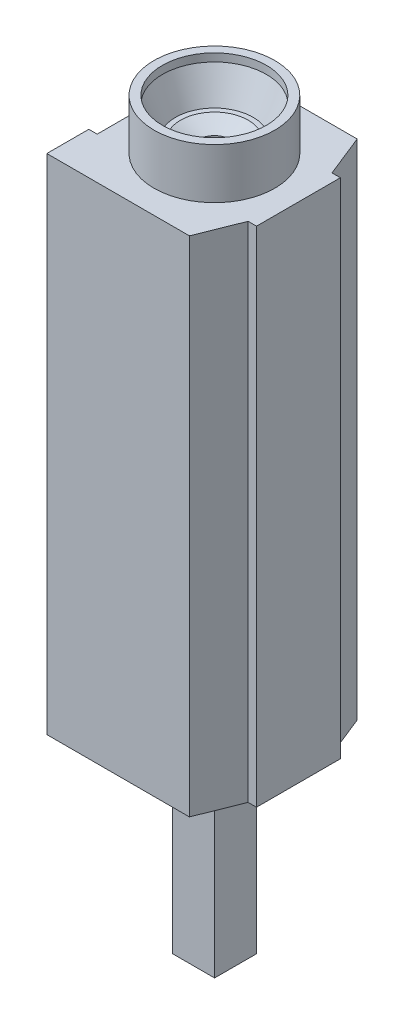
ISO-10303-21;
HEADER;
FILE_DESCRIPTION(('STEP AP214'),'2;1');
FILE_NAME('part.step','',(''),(''),'','','');
FILE_SCHEMA(('AUTOMOTIVE_DESIGN { 1 0 10303 214 1 1 1 1 }'));
ENDSEC;
DATA;
#1=APPLICATION_CONTEXT('core data for automotive mechanical design processes');
#2=APPLICATION_PROTOCOL_DEFINITION('international standard','automotive_design',2000,#1);
#3=PRODUCT_CONTEXT('',#1,'mechanical');
#4=PRODUCT('Part','Part','',(#3));
#5=PRODUCT_RELATED_PRODUCT_CATEGORY('part','',(#4));
#6=PRODUCT_DEFINITION_FORMATION('','',#4);
#7=PRODUCT_DEFINITION_CONTEXT('part definition',#1,'design');
#8=PRODUCT_DEFINITION('design','',#6,#7);
#9=PRODUCT_DEFINITION_SHAPE('','',#8);
#10=(LENGTH_UNIT() NAMED_UNIT(*) SI_UNIT(.MILLI.,.METRE.));
#11=(NAMED_UNIT(*) PLANE_ANGLE_UNIT() SI_UNIT($,.RADIAN.));
#12=(NAMED_UNIT(*) SI_UNIT($,.STERADIAN.) SOLID_ANGLE_UNIT());
#13=UNCERTAINTY_MEASURE_WITH_UNIT(LENGTH_MEASURE(1.E-05),#10,'distance_accuracy_value','');
#14=(GEOMETRIC_REPRESENTATION_CONTEXT(3) GLOBAL_UNCERTAINTY_ASSIGNED_CONTEXT((#13)) GLOBAL_UNIT_ASSIGNED_CONTEXT((#10,
#11,#12)) REPRESENTATION_CONTEXT('',''));
#15=CARTESIAN_POINT('',(0.,0.,0.));
#16=DIRECTION('',(0.,0.,1.));
#17=DIRECTION('',(1.,0.,0.));
#18=AXIS2_PLACEMENT_3D('',#15,#16,#17);
#19=CARTESIAN_POINT('',(-1.27,0.,0.635));
#20=DIRECTION('',(0.,1.,0.));
#21=DIRECTION('',(0.,0.,1.));
#22=AXIS2_PLACEMENT_3D('',#19,#20,#21);
#23=PLANE('',#22);
#24=DIRECTION('',(-0.371390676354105,0.,-0.928476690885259));
#25=VECTOR('',#24,1.);
#26=CARTESIAN_POINT('',(1.143,0.,-0.635000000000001));
#27=LINE('',#26,#25);
#28=CARTESIAN_POINT('',(1.143,0.,-0.635000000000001));
#29=VERTEX_POINT('',#28);
#30=CARTESIAN_POINT('',(0.889000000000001,0.,-1.27));
#31=VERTEX_POINT('',#30);
#32=EDGE_CURVE('E211',#29,#31,#27,.T.);
#33=ORIENTED_EDGE('',*,*,#32,.F.);
#34=DIRECTION('',(1.,0.,0.));
#35=VECTOR('',#34,1.);
#36=CARTESIAN_POINT('',(-1.27,0.,-0.635000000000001));
#37=LINE('',#36,#35);
#38=CARTESIAN_POINT('',(1.27,0.,-0.635000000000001));
#39=VERTEX_POINT('',#38);
#40=EDGE_CURVE('E297',#29,#39,#37,.T.);
#41=ORIENTED_EDGE('',*,*,#40,.T.);
#42=DIRECTION('',(0.,0.,-1.));
#43=VECTOR('',#42,1.);
#44=CARTESIAN_POINT('',(1.27,0.,-1.27));
#45=LINE('',#44,#43);
#46=CARTESIAN_POINT('',(1.27,0.,0.635000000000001));
#47=VERTEX_POINT('',#46);
#48=EDGE_CURVE('E276',#47,#39,#45,.T.);
#49=ORIENTED_EDGE('',*,*,#48,.F.);
#50=DIRECTION('',(1.,0.,0.));
#51=VECTOR('',#50,1.);
#52=CARTESIAN_POINT('',(1.397,0.,0.635000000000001));
#53=LINE('',#52,#51);
#54=CARTESIAN_POINT('',(1.143,0.,0.635000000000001));
#55=VERTEX_POINT('',#54);
#56=EDGE_CURVE('E225',#55,#47,#53,.T.);
#57=ORIENTED_EDGE('',*,*,#56,.F.);
#58=DIRECTION('',(0.371390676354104,0.,-0.928476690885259));
#59=VECTOR('',#58,1.);
#60=CARTESIAN_POINT('',(1.143,0.,0.635000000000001));
#61=LINE('',#60,#59);
#62=CARTESIAN_POINT('',(0.889,0.,1.27));
#63=VERTEX_POINT('',#62);
#64=EDGE_CURVE('E227',#63,#55,#61,.T.);
#65=ORIENTED_EDGE('',*,*,#64,.F.);
#66=DIRECTION('',(1.,0.,0.));
#67=VECTOR('',#66,1.);
#68=CARTESIAN_POINT('',(-1.27,0.,1.27));
#69=LINE('',#68,#67);
#70=CARTESIAN_POINT('',(-1.27,0.,1.27));
#71=VERTEX_POINT('',#70);
#72=EDGE_CURVE('E273',#71,#63,#69,.T.);
#73=ORIENTED_EDGE('',*,*,#72,.F.);
#74=DIRECTION('',(0.,0.,1.));
#75=VECTOR('',#74,1.);
#76=CARTESIAN_POINT('',(-1.27,0.,0.635));
#77=LINE('',#76,#75);
#78=CARTESIAN_POINT('',(-1.27,0.,0.635));
#79=VERTEX_POINT('',#78);
#80=EDGE_CURVE('E271',#79,#71,#77,.T.);
#81=ORIENTED_EDGE('',*,*,#80,.F.);
#82=DIRECTION('',(-1.,0.,0.));
#83=VECTOR('',#82,1.);
#84=CARTESIAN_POINT('',(-1.27,0.,0.635));
#85=LINE('',#84,#83);
#86=CARTESIAN_POINT('',(-1.143,0.,0.635));
#87=VERTEX_POINT('',#86);
#88=EDGE_CURVE('E269',#87,#79,#85,.T.);
#89=ORIENTED_EDGE('',*,*,#88,.F.);
#90=DIRECTION('',(0.,0.,1.));
#91=VECTOR('',#90,1.);
#92=CARTESIAN_POINT('',(-1.143,0.,-0.635));
#93=LINE('',#92,#91);
#94=CARTESIAN_POINT('',(-1.143,0.,-0.635));
#95=VERTEX_POINT('',#94);
#96=EDGE_CURVE('E267',#95,#87,#93,.T.);
#97=ORIENTED_EDGE('',*,*,#96,.F.);
#98=DIRECTION('',(1.,0.,0.));
#99=VECTOR('',#98,1.);
#100=CARTESIAN_POINT('',(-1.27,0.,-0.635));
#101=LINE('',#100,#99);
#102=CARTESIAN_POINT('',(-1.27,0.,-0.635));
#103=VERTEX_POINT('',#102);
#104=EDGE_CURVE('E265',#103,#95,#101,.T.);
#105=ORIENTED_EDGE('',*,*,#104,.F.);
#106=DIRECTION('',(0.,0.,1.));
#107=VECTOR('',#106,1.);
#108=CARTESIAN_POINT('',(-1.27,0.,-1.27));
#109=LINE('',#108,#107);
#110=CARTESIAN_POINT('',(-1.27,0.,-1.27));
#111=VERTEX_POINT('',#110);
#112=EDGE_CURVE('E241',#111,#103,#109,.T.);
#113=ORIENTED_EDGE('',*,*,#112,.F.);
#114=DIRECTION('',(-1.,0.,0.));
#115=VECTOR('',#114,1.);
#116=CARTESIAN_POINT('',(-1.27,0.,-1.27));
#117=LINE('',#116,#115);
#118=EDGE_CURVE('E246',#31,#111,#117,.T.);
#119=ORIENTED_EDGE('',*,*,#118,.F.);
#120=EDGE_LOOP('',(#33,#41,#49,#57,#65,#73,#81,#89,#97,#105,#113,#119));
#121=FACE_BOUND('',#120,.T.);
#122=DIRECTION('',(0.,0.,-1.));
#123=VECTOR('',#122,1.);
#124=CARTESIAN_POINT('',(-0.317499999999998,0.,0.3175));
#125=LINE('',#124,#123);
#126=CARTESIAN_POINT('',(-0.317499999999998,0.,0.3175));
#127=VERTEX_POINT('',#126);
#128=CARTESIAN_POINT('',(-0.317499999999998,0.,-0.3175));
#129=VERTEX_POINT('',#128);
#130=EDGE_CURVE('E164',#127,#129,#125,.T.);
#131=ORIENTED_EDGE('',*,*,#130,.F.);
#132=DIRECTION('',(-1.,0.,0.));
#133=VECTOR('',#132,1.);
#134=CARTESIAN_POINT('',(-0.317499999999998,0.,0.3175));
#135=LINE('',#134,#133);
#136=CARTESIAN_POINT('',(0.317500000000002,0.,0.317500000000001));
#137=VERTEX_POINT('',#136);
#138=EDGE_CURVE('E171',#137,#127,#135,.T.);
#139=ORIENTED_EDGE('',*,*,#138,.F.);
#140=DIRECTION('',(0.,0.,1.));
#141=VECTOR('',#140,1.);
#142=CARTESIAN_POINT('',(0.317500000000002,0.,0.317500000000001));
#143=LINE('',#142,#141);
#144=CARTESIAN_POINT('',(0.317500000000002,0.,-0.3175));
#145=VERTEX_POINT('',#144);
#146=EDGE_CURVE('E182',#145,#137,#143,.T.);
#147=ORIENTED_EDGE('',*,*,#146,.F.);
#148=DIRECTION('',(1.,0.,0.));
#149=VECTOR('',#148,1.);
#150=CARTESIAN_POINT('',(-0.317499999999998,0.,-0.3175));
#151=LINE('',#150,#149);
#152=EDGE_CURVE('E179',#129,#145,#151,.T.);
#153=ORIENTED_EDGE('',*,*,#152,.F.);
#154=EDGE_LOOP('',(#131,#139,#147,#153));
#155=FACE_BOUND('',#154,.T.);
#156=ADVANCED_FACE('F35',(#121,#155),#23,.F.);
#157=CARTESIAN_POINT('',(-1.27,7.62,-1.27));
#158=DIRECTION('',(1.,0.,0.));
#159=DIRECTION('',(0.,0.,-1.));
#160=AXIS2_PLACEMENT_3D('',#157,#158,#159);
#161=PLANE('',#160);
#162=ORIENTED_EDGE('',*,*,#112,.T.);
#163=DIRECTION('',(0.,-1.,0.));
#164=VECTOR('',#163,1.);
#165=CARTESIAN_POINT('',(-1.27,7.62,-0.635));
#166=LINE('',#165,#164);
#167=CARTESIAN_POINT('',(-1.27,7.62,-0.635));
#168=VERTEX_POINT('',#167);
#169=EDGE_CURVE('E294',#168,#103,#166,.T.);
#170=ORIENTED_EDGE('',*,*,#169,.F.);
#171=DIRECTION('',(0.,0.,1.));
#172=VECTOR('',#171,1.);
#173=CARTESIAN_POINT('',(-1.27,7.62,-1.27));
#174=LINE('',#173,#172);
#175=CARTESIAN_POINT('',(-1.27,7.62,-1.27));
#176=VERTEX_POINT('',#175);
#177=EDGE_CURVE('E242',#176,#168,#174,.T.);
#178=ORIENTED_EDGE('',*,*,#177,.F.);
#179=DIRECTION('',(0.,-1.,0.));
#180=VECTOR('',#179,1.);
#181=CARTESIAN_POINT('',(-1.27,7.62,-1.27));
#182=LINE('',#181,#180);
#183=EDGE_CURVE('E262',#176,#111,#182,.T.);
#184=ORIENTED_EDGE('',*,*,#183,.T.);
#185=EDGE_LOOP('',(#162,#170,#178,#184));
#186=FACE_BOUND('',#185,.T.);
#187=ADVANCED_FACE('F352',(#186),#161,.F.);
#188=CARTESIAN_POINT('',(-1.27,7.62,-0.635));
#189=DIRECTION('',(0.,0.,-1.));
#190=DIRECTION('',(-1.,0.,0.));
#191=AXIS2_PLACEMENT_3D('',#188,#189,#190);
#192=PLANE('',#191);
#193=ORIENTED_EDGE('',*,*,#104,.T.);
#194=DIRECTION('',(0.,-1.,0.));
#195=VECTOR('',#194,1.);
#196=CARTESIAN_POINT('',(-1.143,7.62,-0.635));
#197=LINE('',#196,#195);
#198=CARTESIAN_POINT('',(-1.143,7.62,-0.635));
#199=VERTEX_POINT('',#198);
#200=EDGE_CURVE('E291',#199,#95,#197,.T.);
#201=ORIENTED_EDGE('',*,*,#200,.F.);
#202=DIRECTION('',(1.,0.,0.));
#203=VECTOR('',#202,1.);
#204=CARTESIAN_POINT('',(-1.27,7.62,-0.635));
#205=LINE('',#204,#203);
#206=EDGE_CURVE('E245',#168,#199,#205,.T.);
#207=ORIENTED_EDGE('',*,*,#206,.F.);
#208=ORIENTED_EDGE('',*,*,#169,.T.);
#209=EDGE_LOOP('',(#193,#201,#207,#208));
#210=FACE_BOUND('',#209,.T.);
#211=ADVANCED_FACE('F358',(#210),#192,.F.);
#212=CARTESIAN_POINT('',(-1.143,7.62,-0.635));
#213=DIRECTION('',(1.,0.,0.));
#214=DIRECTION('',(0.,0.,-1.));
#215=AXIS2_PLACEMENT_3D('',#212,#213,#214);
#216=PLANE('',#215);
#217=ORIENTED_EDGE('',*,*,#96,.T.);
#218=DIRECTION('',(0.,-1.,0.));
#219=VECTOR('',#218,1.);
#220=CARTESIAN_POINT('',(-1.143,7.62,0.635));
#221=LINE('',#220,#219);
#222=CARTESIAN_POINT('',(-1.143,7.62,0.635));
#223=VERTEX_POINT('',#222);
#224=EDGE_CURVE('E288',#223,#87,#221,.T.);
#225=ORIENTED_EDGE('',*,*,#224,.F.);
#226=DIRECTION('',(0.,0.,1.));
#227=VECTOR('',#226,1.);
#228=CARTESIAN_POINT('',(-1.143,7.62,-0.635));
#229=LINE('',#228,#227);
#230=EDGE_CURVE('E248',#199,#223,#229,.T.);
#231=ORIENTED_EDGE('',*,*,#230,.F.);
#232=ORIENTED_EDGE('',*,*,#200,.T.);
#233=EDGE_LOOP('',(#217,#225,#231,#232));
#234=FACE_BOUND('',#233,.T.);
#235=ADVANCED_FACE('F385',(#234),#216,.F.);
#236=CARTESIAN_POINT('',(-1.27,7.62,0.635));
#237=DIRECTION('',(0.,0.,1.));
#238=DIRECTION('',(1.,0.,0.));
#239=AXIS2_PLACEMENT_3D('',#236,#237,#238);
#240=PLANE('',#239);
#241=ORIENTED_EDGE('',*,*,#88,.T.);
#242=DIRECTION('',(0.,-1.,0.));
#243=VECTOR('',#242,1.);
#244=CARTESIAN_POINT('',(-1.27,7.62,0.635));
#245=LINE('',#244,#243);
#246=CARTESIAN_POINT('',(-1.27,7.62,0.635));
#247=VERTEX_POINT('',#246);
#248=EDGE_CURVE('E285',#247,#79,#245,.T.);
#249=ORIENTED_EDGE('',*,*,#248,.F.);
#250=DIRECTION('',(-1.,0.,0.));
#251=VECTOR('',#250,1.);
#252=CARTESIAN_POINT('',(-1.27,7.62,0.635));
#253=LINE('',#252,#251);
#254=EDGE_CURVE('E250',#223,#247,#253,.T.);
#255=ORIENTED_EDGE('',*,*,#254,.F.);
#256=ORIENTED_EDGE('',*,*,#224,.T.);
#257=EDGE_LOOP('',(#241,#249,#255,#256));
#258=FACE_BOUND('',#257,.T.);
#259=ADVANCED_FACE('F381',(#258),#240,.F.);
#260=CARTESIAN_POINT('',(-1.27,7.62,0.635));
#261=DIRECTION('',(1.,0.,0.));
#262=DIRECTION('',(0.,0.,-1.));
#263=AXIS2_PLACEMENT_3D('',#260,#261,#262);
#264=PLANE('',#263);
#265=ORIENTED_EDGE('',*,*,#80,.T.);
#266=DIRECTION('',(0.,-1.,0.));
#267=VECTOR('',#266,1.);
#268=CARTESIAN_POINT('',(-1.27,7.62,1.27));
#269=LINE('',#268,#267);
#270=CARTESIAN_POINT('',(-1.27,7.62,1.27));
#271=VERTEX_POINT('',#270);
#272=EDGE_CURVE('E282',#271,#71,#269,.T.);
#273=ORIENTED_EDGE('',*,*,#272,.F.);
#274=DIRECTION('',(0.,0.,1.));
#275=VECTOR('',#274,1.);
#276=CARTESIAN_POINT('',(-1.27,7.62,0.635));
#277=LINE('',#276,#275);
#278=EDGE_CURVE('E252',#247,#271,#277,.T.);
#279=ORIENTED_EDGE('',*,*,#278,.F.);
#280=ORIENTED_EDGE('',*,*,#248,.T.);
#281=EDGE_LOOP('',(#265,#273,#279,#280));
#282=FACE_BOUND('',#281,.T.);
#283=ADVANCED_FACE('F377',(#282),#264,.F.);
#284=CARTESIAN_POINT('',(-1.27,7.62,1.27));
#285=DIRECTION('',(0.,0.,-1.));
#286=DIRECTION('',(-1.,0.,0.));
#287=AXIS2_PLACEMENT_3D('',#284,#285,#286);
#288=PLANE('',#287);
#289=ORIENTED_EDGE('',*,*,#72,.T.);
#290=DIRECTION('',(0.,1.,0.));
#291=VECTOR('',#290,1.);
#292=CARTESIAN_POINT('',(0.889000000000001,-0.991901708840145,1.27));
#293=LINE('',#292,#291);
#294=CARTESIAN_POINT('',(0.889000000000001,7.62,1.27));
#295=VERTEX_POINT('',#294);
#296=EDGE_CURVE('E228',#63,#295,#293,.T.);
#297=ORIENTED_EDGE('',*,*,#296,.T.);
#298=DIRECTION('',(1.,0.,0.));
#299=VECTOR('',#298,1.);
#300=CARTESIAN_POINT('',(-1.27,7.62,1.27));
#301=LINE('',#300,#299);
#302=EDGE_CURVE('E254',#271,#295,#301,.T.);
#303=ORIENTED_EDGE('',*,*,#302,.F.);
#304=ORIENTED_EDGE('',*,*,#272,.T.);
#305=EDGE_LOOP('',(#289,#297,#303,#304));
#306=FACE_BOUND('',#305,.T.);
#307=ADVANCED_FACE('F373',(#306),#288,.F.);
#308=CARTESIAN_POINT('',(1.27,7.62,-1.27));
#309=DIRECTION('',(-1.,0.,0.));
#310=DIRECTION('',(0.,0.,1.));
#311=AXIS2_PLACEMENT_3D('',#308,#309,#310);
#312=PLANE('',#311);
#313=ORIENTED_EDGE('',*,*,#48,.T.);
#314=DIRECTION('',(0.,1.,0.));
#315=VECTOR('',#314,1.);
#316=CARTESIAN_POINT('',(1.27,7.62,-0.635000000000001));
#317=LINE('',#316,#315);
#318=CARTESIAN_POINT('',(1.27,7.62,-0.635000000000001));
#319=VERTEX_POINT('',#318);
#320=EDGE_CURVE('E213',#39,#319,#317,.T.);
#321=ORIENTED_EDGE('',*,*,#320,.T.);
#322=DIRECTION('',(0.,0.,-1.));
#323=VECTOR('',#322,1.);
#324=CARTESIAN_POINT('',(1.27,7.62,-1.27));
#325=LINE('',#324,#323);
#326=CARTESIAN_POINT('',(1.27,7.62,0.635000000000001));
#327=VERTEX_POINT('',#326);
#328=EDGE_CURVE('E257',#327,#319,#325,.T.);
#329=ORIENTED_EDGE('',*,*,#328,.F.);
#330=DIRECTION('',(0.,-1.,0.));
#331=VECTOR('',#330,1.);
#332=CARTESIAN_POINT('',(1.27,7.62,0.635000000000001));
#333=LINE('',#332,#331);
#334=EDGE_CURVE('E238',#327,#47,#333,.T.);
#335=ORIENTED_EDGE('',*,*,#334,.T.);
#336=EDGE_LOOP('',(#313,#321,#329,#335));
#337=FACE_BOUND('',#336,.T.);
#338=ADVANCED_FACE('F369',(#337),#312,.F.);
#339=CARTESIAN_POINT('',(-1.27,7.62,-1.27));
#340=DIRECTION('',(0.,0.,1.));
#341=DIRECTION('',(1.,0.,0.));
#342=AXIS2_PLACEMENT_3D('',#339,#340,#341);
#343=PLANE('',#342);
#344=DIRECTION('',(-1.,0.,0.));
#345=VECTOR('',#344,1.);
#346=CARTESIAN_POINT('',(-1.27,7.62,-1.27));
#347=LINE('',#346,#345);
#348=CARTESIAN_POINT('',(0.889000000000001,7.62,-1.27));
#349=VERTEX_POINT('',#348);
#350=EDGE_CURVE('E260',#349,#176,#347,.T.);
#351=ORIENTED_EDGE('',*,*,#350,.F.);
#352=DIRECTION('',(0.,1.,0.));
#353=VECTOR('',#352,1.);
#354=CARTESIAN_POINT('',(0.889000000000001,-0.991901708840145,-1.27));
#355=LINE('',#354,#353);
#356=EDGE_CURVE('E219',#31,#349,#355,.T.);
#357=ORIENTED_EDGE('',*,*,#356,.F.);
#358=ORIENTED_EDGE('',*,*,#118,.T.);
#359=ORIENTED_EDGE('',*,*,#183,.F.);
#360=EDGE_LOOP('',(#351,#357,#358,#359));
#361=FACE_BOUND('',#360,.T.);
#362=ADVANCED_FACE('F366',(#361),#343,.F.);
#363=CARTESIAN_POINT('',(-1.27,7.62,0.635));
#364=DIRECTION('',(0.,1.,0.));
#365=DIRECTION('',(0.,0.,1.));
#366=AXIS2_PLACEMENT_3D('',#363,#364,#365);
#367=PLANE('',#366);
#368=CARTESIAN_POINT('',(-0.00254,7.62,0.));
#369=DIRECTION('',(0.,1.,0.));
#370=DIRECTION('',(0.,0.,1.));
#371=AXIS2_PLACEMENT_3D('',#368,#369,#370);
#372=CIRCLE('',#371,0.914400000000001);
#373=CARTESIAN_POINT('',(-0.00254,7.62,0.914400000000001));
#374=VERTEX_POINT('',#373);
#375=EDGE_CURVE('E300',#374,#374,#372,.T.);
#376=ORIENTED_EDGE('',*,*,#375,.F.);
#377=EDGE_LOOP('',(#376));
#378=FACE_BOUND('',#377,.T.);
#379=DIRECTION('',(1.,0.,0.));
#380=VECTOR('',#379,1.);
#381=CARTESIAN_POINT('',(1.397,7.62,-0.635000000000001));
#382=LINE('',#381,#380);
#383=CARTESIAN_POINT('',(1.143,7.62,-0.635000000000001));
#384=VERTEX_POINT('',#383);
#385=EDGE_CURVE('E217',#384,#319,#382,.T.);
#386=ORIENTED_EDGE('',*,*,#385,.F.);
#387=DIRECTION('',(0.371390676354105,0.,0.928476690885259));
#388=VECTOR('',#387,1.);
#389=CARTESIAN_POINT('',(1.143,7.62,-0.635000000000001));
#390=LINE('',#389,#388);
#391=EDGE_CURVE('E210',#349,#384,#390,.T.);
#392=ORIENTED_EDGE('',*,*,#391,.F.);
#393=ORIENTED_EDGE('',*,*,#350,.T.);
#394=ORIENTED_EDGE('',*,*,#177,.T.);
#395=ORIENTED_EDGE('',*,*,#206,.T.);
#396=ORIENTED_EDGE('',*,*,#230,.T.);
#397=ORIENTED_EDGE('',*,*,#254,.T.);
#398=ORIENTED_EDGE('',*,*,#278,.T.);
#399=ORIENTED_EDGE('',*,*,#302,.T.);
#400=DIRECTION('',(-0.371390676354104,0.,0.928476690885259));
#401=VECTOR('',#400,1.);
#402=CARTESIAN_POINT('',(1.143,7.62,0.635000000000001));
#403=LINE('',#402,#401);
#404=CARTESIAN_POINT('',(1.143,7.62,0.635000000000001));
#405=VERTEX_POINT('',#404);
#406=EDGE_CURVE('E230',#405,#295,#403,.T.);
#407=ORIENTED_EDGE('',*,*,#406,.F.);
#408=DIRECTION('',(-1.,0.,0.));
#409=VECTOR('',#408,1.);
#410=CARTESIAN_POINT('',(1.397,7.62,0.635000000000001));
#411=LINE('',#410,#409);
#412=EDGE_CURVE('E224',#327,#405,#411,.T.);
#413=ORIENTED_EDGE('',*,*,#412,.F.);
#414=ORIENTED_EDGE('',*,*,#328,.T.);
#415=EDGE_LOOP('',(#386,#392,#393,#394,#395,#396,#397,#398,#399,#407,#413,#414));
#416=FACE_BOUND('',#415,.T.);
#417=ADVANCED_FACE('F364',(#378,#416),#367,.T.);
#418=CARTESIAN_POINT('',(1.397,-0.991901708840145,0.635000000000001));
#419=DIRECTION('',(0.,0.,-1.));
#420=DIRECTION('',(-1.,0.,0.));
#421=AXIS2_PLACEMENT_3D('',#418,#419,#420);
#422=PLANE('',#421);
#423=ORIENTED_EDGE('',*,*,#412,.T.);
#424=DIRECTION('',(0.,1.,0.));
#425=VECTOR('',#424,1.);
#426=CARTESIAN_POINT('',(1.143,-0.991901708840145,0.635000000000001));
#427=LINE('',#426,#425);
#428=EDGE_CURVE('E232',#55,#405,#427,.T.);
#429=ORIENTED_EDGE('',*,*,#428,.F.);
#430=ORIENTED_EDGE('',*,*,#56,.T.);
#431=ORIENTED_EDGE('',*,*,#334,.F.);
#432=EDGE_LOOP('',(#423,#429,#430,#431));
#433=FACE_BOUND('',#432,.T.);
#434=ADVANCED_FACE('F520',(#433),#422,.F.);
#435=CARTESIAN_POINT('',(1.143,-0.991901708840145,0.635000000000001));
#436=DIRECTION('',(-0.928476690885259,0.,-0.371390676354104));
#437=DIRECTION('',(-0.371390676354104,0.,0.928476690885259));
#438=AXIS2_PLACEMENT_3D('',#435,#436,#437);
#439=PLANE('',#438);
#440=ORIENTED_EDGE('',*,*,#64,.T.);
#441=ORIENTED_EDGE('',*,*,#428,.T.);
#442=ORIENTED_EDGE('',*,*,#406,.T.);
#443=ORIENTED_EDGE('',*,*,#296,.F.);
#444=EDGE_LOOP('',(#440,#441,#442,#443));
#445=FACE_BOUND('',#444,.T.);
#446=ADVANCED_FACE('F540',(#445),#439,.F.);
#447=CARTESIAN_POINT('',(1.397,-0.991901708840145,-0.635000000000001));
#448=DIRECTION('',(0.,0.,1.));
#449=DIRECTION('',(1.,0.,0.));
#450=AXIS2_PLACEMENT_3D('',#447,#448,#449);
#451=PLANE('',#450);
#452=ORIENTED_EDGE('',*,*,#40,.F.);
#453=DIRECTION('',(0.,1.,0.));
#454=VECTOR('',#453,1.);
#455=CARTESIAN_POINT('',(1.143,-0.991901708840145,-0.635000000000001));
#456=LINE('',#455,#454);
#457=EDGE_CURVE('E214',#29,#384,#456,.T.);
#458=ORIENTED_EDGE('',*,*,#457,.T.);
#459=ORIENTED_EDGE('',*,*,#385,.T.);
#460=ORIENTED_EDGE('',*,*,#320,.F.);
#461=EDGE_LOOP('',(#452,#458,#459,#460));
#462=FACE_BOUND('',#461,.T.);
#463=ADVANCED_FACE('F530',(#462),#451,.F.);
#464=CARTESIAN_POINT('',(1.143,-0.991901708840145,-0.635000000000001));
#465=DIRECTION('',(-0.928476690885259,0.,0.371390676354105));
#466=DIRECTION('',(0.371390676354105,0.,0.928476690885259));
#467=AXIS2_PLACEMENT_3D('',#464,#465,#466);
#468=PLANE('',#467);
#469=ORIENTED_EDGE('',*,*,#32,.T.);
#470=ORIENTED_EDGE('',*,*,#356,.T.);
#471=ORIENTED_EDGE('',*,*,#391,.T.);
#472=ORIENTED_EDGE('',*,*,#457,.F.);
#473=EDGE_LOOP('',(#469,#470,#471,#472));
#474=FACE_BOUND('',#473,.T.);
#475=ADVANCED_FACE('F509',(#474),#468,.F.);
#476=CARTESIAN_POINT('',(-0.00254,0.337825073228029,0.));
#477=DIRECTION('',(0.,1.,0.));
#478=DIRECTION('',(0.,0.,1.));
#479=AXIS2_PLACEMENT_3D('',#476,#477,#478);
#480=CYLINDRICAL_SURFACE('',#479,0.239911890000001);
#481=CARTESIAN_POINT('',(-0.00254,7.684152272,0.));
#482=DIRECTION('',(0.,1.,0.));
#483=DIRECTION('',(0.,0.,1.));
#484=AXIS2_PLACEMENT_3D('',#481,#482,#483);
#485=CIRCLE('',#484,0.239911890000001);
#486=CARTESIAN_POINT('',(-0.00254,7.684152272,0.239911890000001));
#487=VERTEX_POINT('',#486);
#488=EDGE_CURVE('E192',#487,#487,#485,.T.);
#489=ORIENTED_EDGE('',*,*,#488,.T.);
#490=EDGE_LOOP('',(#489));
#491=FACE_BOUND('',#490,.T.);
#492=CARTESIAN_POINT('',(-0.00254,7.62,0.));
#493=DIRECTION('',(0.,1.,0.));
#494=DIRECTION('',(0.,0.,1.));
#495=AXIS2_PLACEMENT_3D('',#492,#493,#494);
#496=CIRCLE('',#495,0.239911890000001);
#497=CARTESIAN_POINT('',(-0.00254,7.62,0.239911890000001));
#498=VERTEX_POINT('',#497);
#499=EDGE_CURVE('E303',#498,#498,#496,.F.);
#500=ORIENTED_EDGE('',*,*,#499,.T.);
#501=EDGE_LOOP('',(#500));
#502=FACE_BOUND('',#501,.T.);
#503=ADVANCED_FACE('F500',(#491,#502),#480,.F.);
#504=CARTESIAN_POINT('',(-0.00254,0.337825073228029,0.));
#505=DIRECTION('',(0.,1.,0.));
#506=DIRECTION('',(0.,0.,1.));
#507=AXIS2_PLACEMENT_3D('',#504,#505,#506);
#508=CYLINDRICAL_SURFACE('',#507,0.914400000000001);
#509=ORIENTED_EDGE('',*,*,#375,.T.);
#510=EDGE_LOOP('',(#509));
#511=FACE_BOUND('',#510,.T.);
#512=CARTESIAN_POINT('',(-0.00254,8.382,0.));
#513=DIRECTION('',(0.,1.,0.));
#514=DIRECTION('',(0.,0.,1.));
#515=AXIS2_PLACEMENT_3D('',#512,#513,#514);
#516=CIRCLE('',#515,0.914400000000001);
#517=CARTESIAN_POINT('',(-0.00254,8.382,0.914400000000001));
#518=VERTEX_POINT('',#517);
#519=EDGE_CURVE('E207',#518,#518,#516,.T.);
#520=ORIENTED_EDGE('',*,*,#519,.F.);
#521=EDGE_LOOP('',(#520));
#522=FACE_BOUND('',#521,.T.);
#523=ADVANCED_FACE('F490',(#511,#522),#508,.T.);
#524=CARTESIAN_POINT('',(-0.00254,8.382,0.787400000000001));
#525=DIRECTION('',(0.,1.,0.));
#526=DIRECTION('',(0.,0.,1.));
#527=AXIS2_PLACEMENT_3D('',#524,#525,#526);
#528=PLANE('',#527);
#529=ORIENTED_EDGE('',*,*,#519,.T.);
#530=EDGE_LOOP('',(#529));
#531=FACE_BOUND('',#530,.T.);
#532=CARTESIAN_POINT('',(-0.00254,8.382,0.));
#533=DIRECTION('',(0.,1.,0.));
#534=DIRECTION('',(0.,0.,1.));
#535=AXIS2_PLACEMENT_3D('',#532,#533,#534);
#536=CIRCLE('',#535,0.787400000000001);
#537=CARTESIAN_POINT('',(-0.00254,8.382,0.787400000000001));
#538=VERTEX_POINT('',#537);
#539=EDGE_CURVE('E204',#538,#538,#536,.T.);
#540=ORIENTED_EDGE('',*,*,#539,.F.);
#541=EDGE_LOOP('',(#540));
#542=FACE_BOUND('',#541,.T.);
#543=ADVANCED_FACE('F480',(#531,#542),#528,.T.);
#544=CARTESIAN_POINT('',(-0.00254,0.337825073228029,0.));
#545=DIRECTION('',(0.,1.,0.));
#546=DIRECTION('',(0.,0.,1.));
#547=AXIS2_PLACEMENT_3D('',#544,#545,#546);
#548=CYLINDRICAL_SURFACE('',#547,0.787400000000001);
#549=ORIENTED_EDGE('',*,*,#539,.T.);
#550=EDGE_LOOP('',(#549));
#551=FACE_BOUND('',#550,.T.);
#552=CARTESIAN_POINT('',(-0.00254,8.26246845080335,0.));
#553=DIRECTION('',(0.,1.,0.));
#554=DIRECTION('',(0.,0.,1.));
#555=AXIS2_PLACEMENT_3D('',#552,#553,#554);
#556=CIRCLE('',#555,0.787400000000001);
#557=CARTESIAN_POINT('',(-0.00254,8.26246845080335,0.787400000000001));
#558=VERTEX_POINT('',#557);
#559=EDGE_CURVE('E201',#558,#558,#556,.T.);
#560=ORIENTED_EDGE('',*,*,#559,.F.);
#561=EDGE_LOOP('',(#560));
#562=FACE_BOUND('',#561,.T.);
#563=ADVANCED_FACE('F470',(#551,#562),#548,.F.);
#564=CARTESIAN_POINT('',(-0.00254,7.799946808,0.));
#565=DIRECTION('',(0.,1.,0.));
#566=DIRECTION('',(0.,0.,1.));
#567=AXIS2_PLACEMENT_3D('',#564,#565,#566);
#568=CONICAL_SURFACE('',#567,0.587346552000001,0.408229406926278);
#569=ORIENTED_EDGE('',*,*,#559,.T.);
#570=EDGE_LOOP('',(#569));
#571=FACE_BOUND('',#570,.T.);
#572=CARTESIAN_POINT('',(-0.00254,7.799946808,0.));
#573=DIRECTION('',(0.,1.,0.));
#574=DIRECTION('',(0.,0.,1.));
#575=AXIS2_PLACEMENT_3D('',#572,#573,#574);
#576=CIRCLE('',#575,0.587346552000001);
#577=CARTESIAN_POINT('',(-0.00254,7.799946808,0.587346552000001));
#578=VERTEX_POINT('',#577);
#579=EDGE_CURVE('E198',#578,#578,#576,.T.);
#580=ORIENTED_EDGE('',*,*,#579,.F.);
#581=EDGE_LOOP('',(#580));
#582=FACE_BOUND('',#581,.T.);
#583=ADVANCED_FACE('F460',(#571,#582),#568,.F.);
#584=CARTESIAN_POINT('',(-0.00254,7.799946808,0.587346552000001));
#585=DIRECTION('',(0.,1.,0.));
#586=DIRECTION('',(0.,0.,1.));
#587=AXIS2_PLACEMENT_3D('',#584,#585,#586);
#588=PLANE('',#587);
#589=ORIENTED_EDGE('',*,*,#579,.T.);
#590=EDGE_LOOP('',(#589));
#591=FACE_BOUND('',#590,.T.);
#592=CARTESIAN_POINT('',(-0.00254,7.799946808,0.));
#593=DIRECTION('',(0.,1.,0.));
#594=DIRECTION('',(0.,0.,1.));
#595=AXIS2_PLACEMENT_3D('',#592,#593,#594);
#596=CIRCLE('',#595,0.512312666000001);
#597=CARTESIAN_POINT('',(-0.00254,7.799946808,0.512312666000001));
#598=VERTEX_POINT('',#597);
#599=EDGE_CURVE('E195',#598,#598,#596,.T.);
#600=ORIENTED_EDGE('',*,*,#599,.F.);
#601=EDGE_LOOP('',(#600));
#602=FACE_BOUND('',#601,.T.);
#603=ADVANCED_FACE('F450',(#591,#602),#588,.T.);
#604=CARTESIAN_POINT('',(-0.00254,7.684152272,0.));
#605=DIRECTION('',(0.,1.,0.));
#606=DIRECTION('',(0.,0.,1.));
#607=AXIS2_PLACEMENT_3D('',#604,#605,#606);
#608=CONICAL_SURFACE('',#607,0.239911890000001,1.16885041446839);
#609=ORIENTED_EDGE('',*,*,#599,.T.);
#610=EDGE_LOOP('',(#609));
#611=FACE_BOUND('',#610,.T.);
#612=ORIENTED_EDGE('',*,*,#488,.F.);
#613=EDGE_LOOP('',(#612));
#614=FACE_BOUND('',#613,.T.);
#615=ADVANCED_FACE('F440',(#611,#614),#608,.F.);
#616=ORIENTED_EDGE('',*,*,#499,.F.);
#617=EDGE_LOOP('',(#616));
#618=FACE_BOUND('',#617,.T.);
#619=ADVANCED_FACE('F349',(#618),#367,.T.);
#620=CARTESIAN_POINT('',(-0.317499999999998,-3.1242,0.3175));
#621=DIRECTION('',(1.,0.,0.));
#622=DIRECTION('',(0.,0.,-1.));
#623=AXIS2_PLACEMENT_3D('',#620,#621,#622);
#624=PLANE('',#623);
#625=DIRECTION('',(0.,1.,0.));
#626=VECTOR('',#625,1.);
#627=CARTESIAN_POINT('',(-0.317499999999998,-3.1242,-0.3175));
#628=LINE('',#627,#626);
#629=CARTESIAN_POINT('',(-0.317499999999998,-2.8742,-0.3175));
#630=VERTEX_POINT('',#629);
#631=EDGE_CURVE('E190',#630,#129,#628,.T.);
#632=ORIENTED_EDGE('',*,*,#631,.F.);
#633=DIRECTION('',(0.,0.,1.));
#634=VECTOR('',#633,1.);
#635=CARTESIAN_POINT('',(-0.317499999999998,-2.8742,0.3175));
#636=LINE('',#635,#634);
#637=CARTESIAN_POINT('',(-0.317499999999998,-2.8742,0.3175));
#638=VERTEX_POINT('',#637);
#639=EDGE_CURVE('E11',#630,#638,#636,.T.);
#640=ORIENTED_EDGE('',*,*,#639,.T.);
#641=DIRECTION('',(0.,1.,0.));
#642=VECTOR('',#641,1.);
#643=CARTESIAN_POINT('',(-0.317499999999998,-3.1242,0.3175));
#644=LINE('',#643,#642);
#645=EDGE_CURVE('E161',#638,#127,#644,.T.);
#646=ORIENTED_EDGE('',*,*,#645,.T.);
#647=ORIENTED_EDGE('',*,*,#130,.T.);
#648=EDGE_LOOP('',(#632,#640,#646,#647));
#649=FACE_BOUND('',#648,.T.);
#650=ADVANCED_FACE('F163',(#649),#624,.F.);
#651=CARTESIAN_POINT('',(-0.317499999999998,-3.1242,-0.3175));
#652=DIRECTION('',(0.,0.,1.));
#653=DIRECTION('',(1.,0.,0.));
#654=AXIS2_PLACEMENT_3D('',#651,#652,#653);
#655=PLANE('',#654);
#656=DIRECTION('',(0.,1.,0.));
#657=VECTOR('',#656,1.);
#658=CARTESIAN_POINT('',(0.317500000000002,-3.1242,-0.3175));
#659=LINE('',#658,#657);
#660=CARTESIAN_POINT('',(0.317500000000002,-2.8742,-0.3175));
#661=VERTEX_POINT('',#660);
#662=EDGE_CURVE('E188',#661,#145,#659,.T.);
#663=ORIENTED_EDGE('',*,*,#662,.F.);
#664=DIRECTION('',(-1.,0.,0.));
#665=VECTOR('',#664,1.);
#666=CARTESIAN_POINT('',(-0.317499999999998,-2.8742,-0.3175));
#667=LINE('',#666,#665);
#668=EDGE_CURVE('E44',#661,#630,#667,.T.);
#669=ORIENTED_EDGE('',*,*,#668,.T.);
#670=ORIENTED_EDGE('',*,*,#631,.T.);
#671=ORIENTED_EDGE('',*,*,#152,.T.);
#672=EDGE_LOOP('',(#663,#669,#670,#671));
#673=FACE_BOUND('',#672,.T.);
#674=ADVANCED_FACE('F341',(#673),#655,.F.);
#675=CARTESIAN_POINT('',(0.317500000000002,-3.1242,0.317500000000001));
#676=DIRECTION('',(-1.,0.,0.));
#677=DIRECTION('',(0.,0.,1.));
#678=AXIS2_PLACEMENT_3D('',#675,#676,#677);
#679=PLANE('',#678);
#680=DIRECTION('',(0.,1.,0.));
#681=VECTOR('',#680,1.);
#682=CARTESIAN_POINT('',(0.317500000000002,-3.1242,0.317500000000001));
#683=LINE('',#682,#681);
#684=CARTESIAN_POINT('',(0.317500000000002,-2.8742,0.317500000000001));
#685=VERTEX_POINT('',#684);
#686=EDGE_CURVE('E170',#685,#137,#683,.T.);
#687=ORIENTED_EDGE('',*,*,#686,.F.);
#688=DIRECTION('',(0.,0.,-1.));
#689=VECTOR('',#688,1.);
#690=CARTESIAN_POINT('',(0.317500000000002,-2.8742,-0.3175));
#691=LINE('',#690,#689);
#692=EDGE_CURVE('E59',#685,#661,#691,.T.);
#693=ORIENTED_EDGE('',*,*,#692,.T.);
#694=ORIENTED_EDGE('',*,*,#662,.T.);
#695=ORIENTED_EDGE('',*,*,#146,.T.);
#696=EDGE_LOOP('',(#687,#693,#694,#695));
#697=FACE_BOUND('',#696,.T.);
#698=ADVANCED_FACE('F340',(#697),#679,.F.);
#699=CARTESIAN_POINT('',(-0.317499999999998,-3.1242,0.3175));
#700=DIRECTION('',(0.,0.,-1.));
#701=DIRECTION('',(-1.,0.,0.));
#702=AXIS2_PLACEMENT_3D('',#699,#700,#701);
#703=PLANE('',#702);
#704=ORIENTED_EDGE('',*,*,#645,.F.);
#705=DIRECTION('',(1.,0.,0.));
#706=VECTOR('',#705,1.);
#707=CARTESIAN_POINT('',(0.317500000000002,-2.8742,0.317500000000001));
#708=LINE('',#707,#706);
#709=EDGE_CURVE('E315',#638,#685,#708,.T.);
#710=ORIENTED_EDGE('',*,*,#709,.T.);
#711=ORIENTED_EDGE('',*,*,#686,.T.);
#712=ORIENTED_EDGE('',*,*,#138,.T.);
#713=EDGE_LOOP('',(#704,#710,#711,#712));
#714=FACE_BOUND('',#713,.T.);
#715=ADVANCED_FACE('F181',(#714),#703,.F.);
#716=CARTESIAN_POINT('',(-0.317499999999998,-3.1242,-0.3175));
#717=DIRECTION('',(0.,-1.,0.));
#718=DIRECTION('',(0.,0.,-1.));
#719=AXIS2_PLACEMENT_3D('',#716,#717,#718);
#720=PLANE('',#719);
#721=DIRECTION('',(0.,0.,1.));
#722=VECTOR('',#721,1.);
#723=CARTESIAN_POINT('',(0.0675000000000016,-3.1242,0.317500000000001));
#724=LINE('',#723,#722);
#725=CARTESIAN_POINT('',(0.0675000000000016,-3.1242,-0.0674999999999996));
#726=VERTEX_POINT('',#725);
#727=CARTESIAN_POINT('',(0.0675000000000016,-3.1242,0.0675000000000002));
#728=VERTEX_POINT('',#727);
#729=EDGE_CURVE('E310',#726,#728,#724,.T.);
#730=ORIENTED_EDGE('',*,*,#729,.T.);
#731=DIRECTION('',(-1.,0.,0.));
#732=VECTOR('',#731,1.);
#733=CARTESIAN_POINT('',(-0.317499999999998,-3.1242,0.0675000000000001));
#734=LINE('',#733,#732);
#735=CARTESIAN_POINT('',(-0.0674999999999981,-3.1242,0.0675000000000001));
#736=VERTEX_POINT('',#735);
#737=EDGE_CURVE('E312',#728,#736,#734,.T.);
#738=ORIENTED_EDGE('',*,*,#737,.T.);
#739=DIRECTION('',(0.,0.,-1.));
#740=VECTOR('',#739,1.);
#741=CARTESIAN_POINT('',(-0.0674999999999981,-3.1242,-0.3175));
#742=LINE('',#741,#740);
#743=CARTESIAN_POINT('',(-0.0674999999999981,-3.1242,-0.0674999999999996));
#744=VERTEX_POINT('',#743);
#745=EDGE_CURVE('E306',#736,#744,#742,.T.);
#746=ORIENTED_EDGE('',*,*,#745,.T.);
#747=DIRECTION('',(1.,0.,0.));
#748=VECTOR('',#747,1.);
#749=CARTESIAN_POINT('',(0.317500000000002,-3.1242,-0.0674999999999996));
#750=LINE('',#749,#748);
#751=EDGE_CURVE('E308',#744,#726,#750,.T.);
#752=ORIENTED_EDGE('',*,*,#751,.T.);
#753=EDGE_LOOP('',(#730,#738,#746,#752));
#754=FACE_BOUND('',#753,.T.);
#755=ADVANCED_FACE('F400',(#754),#720,.T.);
#756=CARTESIAN_POINT('',(-0.317499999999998,-3.1242,-0.0674999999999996));
#757=DIRECTION('',(0.,-0.707106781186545,-0.70710678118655));
#758=DIRECTION('',(0.,0.70710678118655,-0.707106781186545));
#759=AXIS2_PLACEMENT_3D('',#756,#757,#758);
#760=PLANE('',#759);
#761=DIRECTION('',(0.577350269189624,-0.577350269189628,0.577350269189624));
#762=VECTOR('',#761,1.);
#763=CARTESIAN_POINT('',(-0.150833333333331,-3.04086666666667,-0.150833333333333));
#764=LINE('',#763,#762);
#765=EDGE_CURVE('E322',#630,#744,#764,.T.);
#766=ORIENTED_EDGE('',*,*,#765,.F.);
#767=ORIENTED_EDGE('',*,*,#668,.F.);
#768=DIRECTION('',(-0.577350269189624,-0.577350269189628,0.577350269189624));
#769=VECTOR('',#768,1.);
#770=CARTESIAN_POINT('',(-0.0608333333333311,-3.25253333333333,0.0608333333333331));
#771=LINE('',#770,#769);
#772=EDGE_CURVE('E39',#726,#661,#771,.F.);
#773=ORIENTED_EDGE('',*,*,#772,.F.);
#774=ORIENTED_EDGE('',*,*,#751,.F.);
#775=EDGE_LOOP('',(#766,#767,#773,#774));
#776=FACE_BOUND('',#775,.T.);
#777=ADVANCED_FACE('F37',(#776),#760,.T.);
#778=CARTESIAN_POINT('',(0.0675000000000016,-3.1242,-0.3175));
#779=DIRECTION('',(0.70710678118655,-0.707106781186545,0.));
#780=DIRECTION('',(0.707106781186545,0.70710678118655,0.));
#781=AXIS2_PLACEMENT_3D('',#778,#779,#780);
#782=PLANE('',#781);
#783=ORIENTED_EDGE('',*,*,#772,.T.);
#784=ORIENTED_EDGE('',*,*,#692,.F.);
#785=DIRECTION('',(-0.577350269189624,-0.577350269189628,-0.577350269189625));
#786=VECTOR('',#785,1.);
#787=CARTESIAN_POINT('',(-0.0608333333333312,-3.25253333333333,-0.0608333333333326));
#788=LINE('',#787,#786);
#789=EDGE_CURVE('E321',#728,#685,#788,.F.);
#790=ORIENTED_EDGE('',*,*,#789,.F.);
#791=ORIENTED_EDGE('',*,*,#729,.F.);
#792=EDGE_LOOP('',(#783,#784,#790,#791));
#793=FACE_BOUND('',#792,.T.);
#794=ADVANCED_FACE('F331',(#793),#782,.T.);
#795=CARTESIAN_POINT('',(-0.0674999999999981,-3.1242,-0.3175));
#796=DIRECTION('',(-0.70710678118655,-0.707106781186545,0.));
#797=DIRECTION('',(0.707106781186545,-0.70710678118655,0.));
#798=AXIS2_PLACEMENT_3D('',#795,#796,#797);
#799=PLANE('',#798);
#800=ORIENTED_EDGE('',*,*,#765,.T.);
#801=ORIENTED_EDGE('',*,*,#745,.F.);
#802=DIRECTION('',(-0.577350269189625,0.577350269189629,0.577350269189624));
#803=VECTOR('',#802,1.);
#804=CARTESIAN_POINT('',(0.0608333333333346,-3.25253333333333,-0.0608333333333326));
#805=LINE('',#804,#803);
#806=EDGE_CURVE('E319',#638,#736,#805,.F.);
#807=ORIENTED_EDGE('',*,*,#806,.F.);
#808=ORIENTED_EDGE('',*,*,#639,.F.);
#809=EDGE_LOOP('',(#800,#801,#807,#808));
#810=FACE_BOUND('',#809,.T.);
#811=ADVANCED_FACE('F336',(#810),#799,.T.);
#812=CARTESIAN_POINT('',(-0.317499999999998,-3.1242,0.0675000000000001));
#813=DIRECTION('',(0.,-0.707106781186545,0.70710678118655));
#814=DIRECTION('',(0.,-0.70710678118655,-0.707106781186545));
#815=AXIS2_PLACEMENT_3D('',#812,#813,#814);
#816=PLANE('',#815);
#817=ORIENTED_EDGE('',*,*,#789,.T.);
#818=ORIENTED_EDGE('',*,*,#709,.F.);
#819=ORIENTED_EDGE('',*,*,#806,.T.);
#820=ORIENTED_EDGE('',*,*,#737,.F.);
#821=EDGE_LOOP('',(#817,#818,#819,#820));
#822=FACE_BOUND('',#821,.T.);
#823=ADVANCED_FACE('F339',(#822),#816,.T.);
#824=CLOSED_SHELL('',(#156,#187,#211,#235,#259,#283,#307,#338,#362,#417,#434,#446,#463,#475,
#503,#523,#543,#563,#583,#603,#615,#619,#650,#674,#698,#715,#755,#777,#794,#811,#823));
#825=MANIFOLD_SOLID_BREP('B2',#824);
#826=ADVANCED_BREP_SHAPE_REPRESENTATION('',(#18,#825),#14);
#827=SHAPE_DEFINITION_REPRESENTATION(#9,#826);
ENDSEC;
END-ISO-10303-21;
